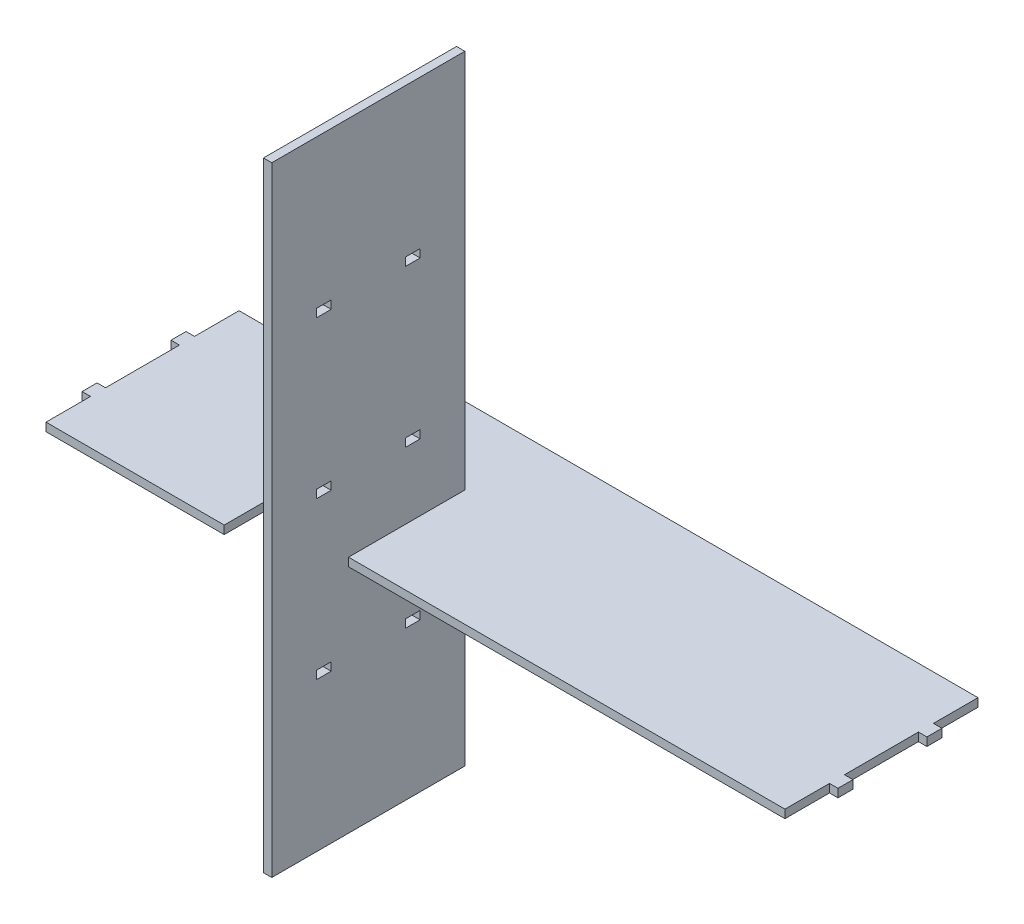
from build123d import *

# Parameters (mm, degrees)
SCHIZZO4_W                   = 130
SCHIZZO4_H                   = 416.834015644
SCHIZZO4_W_2                 = 9.9
SCHIZZO4_H_2                 = 5.5
ESTRUSIONE_ESTRUSIONE1_DEPTH = 5.6
ESTRUSIONE_ESTRUSIONE2_DEPTH = 5.6
ESTRUSIONE_ESTRUSIONE3_DEPTH = 5.6


with BuildPart() as part:
    # Schizzo4 → Estrusione-Estrusione1 (new body)
    with BuildSketch(Plane(origin=(0, 0, 0), x_dir=(0, 0, -1), z_dir=(1, 0, 0))):
        with Locations((-28.579812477, 53.046202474)):
            Rectangle(SCHIZZO4_W, SCHIZZO4_H)
        with Locations((1.370187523, 158.713210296)):
            Rectangle(SCHIZZO4_W_2, SCHIZZO4_H_2, mode=Mode.SUBTRACT)
        with Locations((-58.529812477, 158.713210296)):
            Rectangle(SCHIZZO4_W_2, SCHIZZO4_H_2, mode=Mode.SUBTRACT)
        with Locations((1.370187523, 53.213210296)):
            Rectangle(SCHIZZO4_W_2, SCHIZZO4_H_2, mode=Mode.SUBTRACT)
        with Locations((-58.529812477, 53.213210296)):
            Rectangle(SCHIZZO4_W_2, SCHIZZO4_H_2, mode=Mode.SUBTRACT)
        with Locations((1.370187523, -52.286789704)):
            Rectangle(SCHIZZO4_W_2, SCHIZZO4_H_2, mode=Mode.SUBTRACT)
        with Locations((-58.529812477, -52.286789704)):
            Rectangle(SCHIZZO4_W_2, SCHIZZO4_H_2, mode=Mode.SUBTRACT)
    extrude(amount=ESTRUSIONE_ESTRUSIONE1_DEPTH)


with BuildPart() as body_2:
    # Schizzo5 → Estrusione-Estrusione2 (new body)
    with BuildSketch(Plane(origin=(0, 0, 0), x_dir=(1, 0, 0), z_dir=(0, 1, 0))):
        Polygon((-50.557601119, -11.881440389), (-56.257601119, -11.881440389), (-56.257601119, -1.781440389), (-50.557601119, -1.781440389), (-50.557601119, 48.018559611), (-56.257601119, 48.018559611), (-56.257601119, 58.118559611), (-50.557601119, 58.118559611), (-50.557601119, 88.118559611), (299.442398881, 88.118559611), (299.442398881, 58.118559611), (305.142398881, 58.118559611), (305.142398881, 48.018559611), (299.442398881, 48.018559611), (299.442398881, -1.781440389), (305.142398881, -1.781440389), (305.142398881, -11.881440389), (299.442398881, -11.881440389), (299.442398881, -41.881440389), (-50.557601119, -41.881440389), align=None)
    extrude(amount=ESTRUSIONE_ESTRUSIONE2_DEPTH)


with BuildPart() as body_3:
    # Schizzo6 → Estrusione-Estrusione3 (new body)
    with BuildSketch(Plane(origin=(0, 0, 0), x_dir=(1, 0, 0), z_dir=(0, 1, 0))):
        Polygon((-175, -35), (-180.7, -35), (-180.7, -24.9), (-175, -24.9), (-175, 24.9), (-180.7, 24.9), (-180.7, 35), (-175, 35), (-175, 65), (-55, 65), (-55, -65), (-175, -65), align=None)
    extrude(amount=ESTRUSIONE_ESTRUSIONE3_DEPTH)


solid = Compound([part.part, body_2.part, body_3.part])
